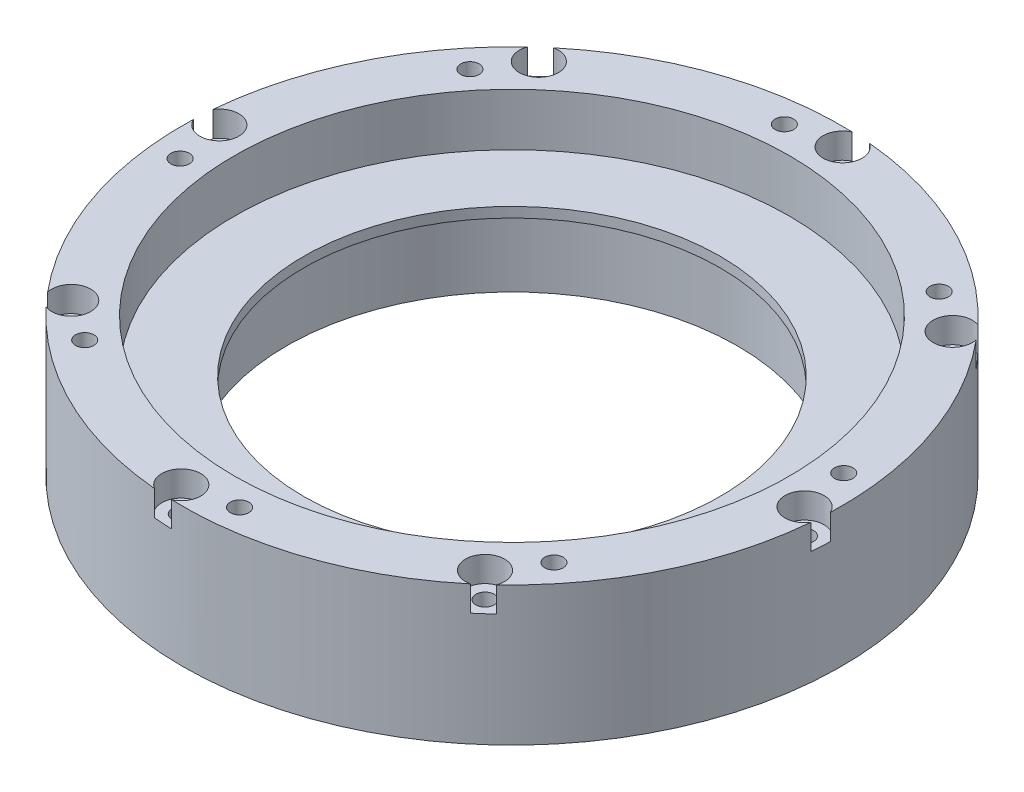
from build123d import *

# Parameters (mm, degrees)
SKETCH1_R                                            = 120.65
BOSS_EXTRUDE1_DEPTH                                  = 50.8
SKETCH3_R                                            = 101.6
CUT_EXTRUDE1_DEPTH                                   = 19.177
SKETCH4_R                                            = 82.55
CUT_EXTRUDE2_DEPTH                                   = 27.94
SKETCH5_R                                            = 76.2
CUT_EXTRUDE3_DEPTH                                   = 174.530571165
F_0_257_DIAMETER_HOLE1_D                             = 6.5278
CBORE_FOR_1_4_BINDING_HEAD_MACHINE_SCREW_D           = 6.7564
CBORE_FOR_1_4_BINDING_HEAD_MACHINE_SCREW_CBORE_D     = 14.2875
CBORE_FOR_1_4_BINDING_HEAD_MACHINE_SCREW_CBORE_DEPTH = 9.271
TAPPED_HOLE_FOR_1_4_20_HELICOIL1_D                   = 6.7564
TAPPED_HOLE_FOR_1_4_20_HELICOIL1_DEPTH               = 17.272
TAPPED_HOLE_FOR_1_4_20_HELICOIL1_TIP                 = 2.029827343


with BuildPart() as part:
    # Sketch1 → Boss-Extrude1 (new body)
    with BuildSketch(Plane(origin=(0, 0, 0), x_dir=(1, 0, 0), z_dir=(0, 1, 0))):
        with Locations(Location((0, 0, 0), (0, 0, 270))):
            Circle(SKETCH1_R)
    extrude(amount=BOSS_EXTRUDE1_DEPTH)

    # Sketch3 → Cut-Extrude1 (cut)
    with BuildSketch(Plane(origin=(0, 50.8, 0), x_dir=(1, 0, 0), z_dir=(0, 1, 0))):
        with Locations(Location((0, 0, 0), (0, 0, 270))):
            Circle(SKETCH3_R)
    extrude(amount=-CUT_EXTRUDE1_DEPTH, mode=Mode.SUBTRACT)

    # Sketch4 → Cut-Extrude2 (cut)
    with BuildSketch(Plane.XZ):
        with Locations(Location((0, 0, 0), (0, 0, 270))):
            Circle(SKETCH4_R)
    extrude(amount=-CUT_EXTRUDE2_DEPTH, mode=Mode.SUBTRACT)

    # Sketch5 → Cut-Extrude3 (cut, through all)
    with BuildSketch(Plane(origin=(0, 31.623, 0), x_dir=(1, 0, 0), z_dir=(0, 1, 0))):
        with Locations(Location((0, 0, 0), (0, 0, 270))):
            Circle(SKETCH5_R)
    extrude(amount=-CUT_EXTRUDE3_DEPTH, mode=Mode.SUBTRACT)

    # F _0.257_ Diameter Hole1 (through all)
    with Locations(Plane(origin=(0, 0, 0), x_dir=(-1, 0, 0), z_dir=(0, -1, 0))):
        with Locations((75.746212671, 85.597904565), (-6.966198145, 114.087519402), (114.087519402, 6.966198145), (85.597904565, -75.746212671), (6.966198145, -114.087519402), (-75.746212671, -85.597904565), (-114.087519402, -6.966198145), (-85.597904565, 75.746212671)):
            Hole(F_0_257_DIAMETER_HOLE1_D / 2)

    # CBORE for 1_4 Binding Head Machine Screw (through all)
    with Locations(Plane(origin=(0, 50.8, 0), x_dir=(1, 0, 0), z_dir=(0, 1, 0))):
        with Locations((-6.966198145, -114.087519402), (75.746212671, -85.597904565), (-85.597904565, -75.746212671), (-114.087519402, 6.966198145), (-75.746212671, 85.597904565), (6.966198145, 114.087519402), (85.597904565, 75.746212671), (114.087519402, -6.966198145)):
            CounterBoreHole(CBORE_FOR_1_4_BINDING_HEAD_MACHINE_SCREW_D / 2, CBORE_FOR_1_4_BINDING_HEAD_MACHINE_SCREW_CBORE_D / 2, CBORE_FOR_1_4_BINDING_HEAD_MACHINE_SCREW_CBORE_DEPTH)

    # Tapped Hole for 1_4-20 Helicoil1
    with Locations(Plane(origin=(0, 50.8, 0), x_dir=(1, 0, 0), z_dir=(0, 1, 0))):
        with Locations((85.890486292, -70.509502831), (10.875997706, -110.591492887), (-70.509503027, -85.890486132), (-110.591492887, -10.875997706), (-85.890486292, 70.509502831), (-10.875997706, 110.591492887), (70.509502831, 85.890486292), (110.591492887, 10.875997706)):
            Hole(TAPPED_HOLE_FOR_1_4_20_HELICOIL1_D / 2, depth=TAPPED_HOLE_FOR_1_4_20_HELICOIL1_DEPTH)
            with Locations((0, 0, -(TAPPED_HOLE_FOR_1_4_20_HELICOIL1_DEPTH + TAPPED_HOLE_FOR_1_4_20_HELICOIL1_TIP / 2))):  # 118° drill point
                Cone(0, TAPPED_HOLE_FOR_1_4_20_HELICOIL1_D / 2, TAPPED_HOLE_FOR_1_4_20_HELICOIL1_TIP, mode=Mode.SUBTRACT)


solid = part.part
